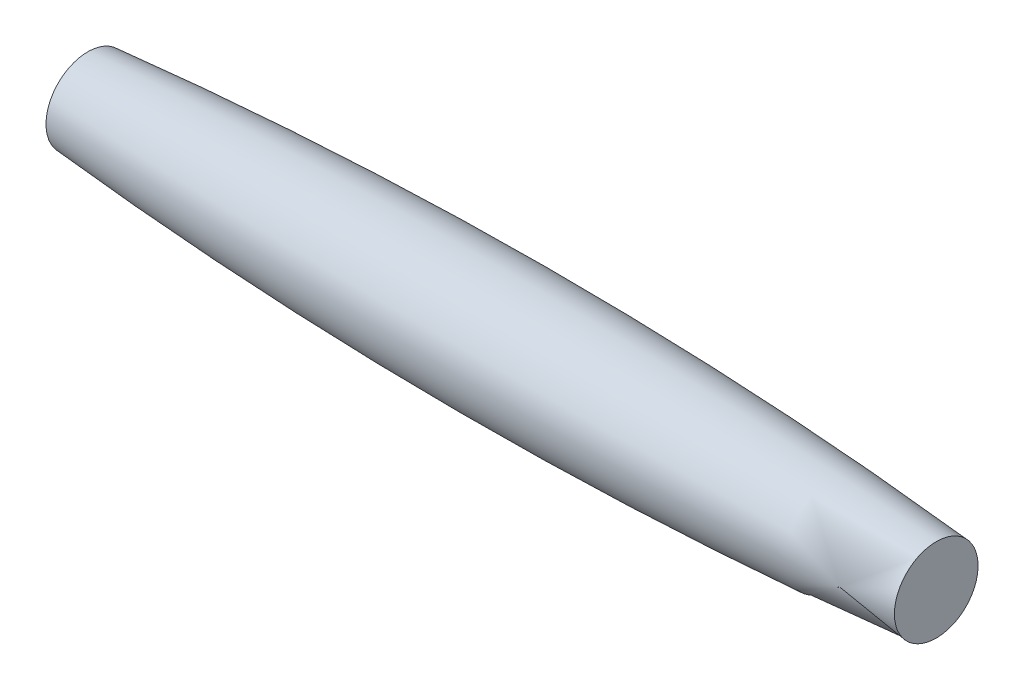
from build123d import *


with BuildPart() as part:
    # Skizze1 → Rotation1 (revolve)
    with BuildSketch(Plane.XY, mode=Mode.PRIVATE) as rotation1_sk:
        with BuildLine():
            Line((-1420, 0), (-1420, 140))
            ThreePointArc((-1420, 140), (0, 200), (1420, 140))
            Line((1420, 140), (1420, 0))
            Line((1420, 0), (-1420, 0))
        make_face()
    revolve(rotation1_sk.sketch.rotate(Axis((-1420, 0, 0), (1, 0, 0)), 90), axis=Axis((-1420, 0, 0), (1, 0, 0)))


solid = part.part
